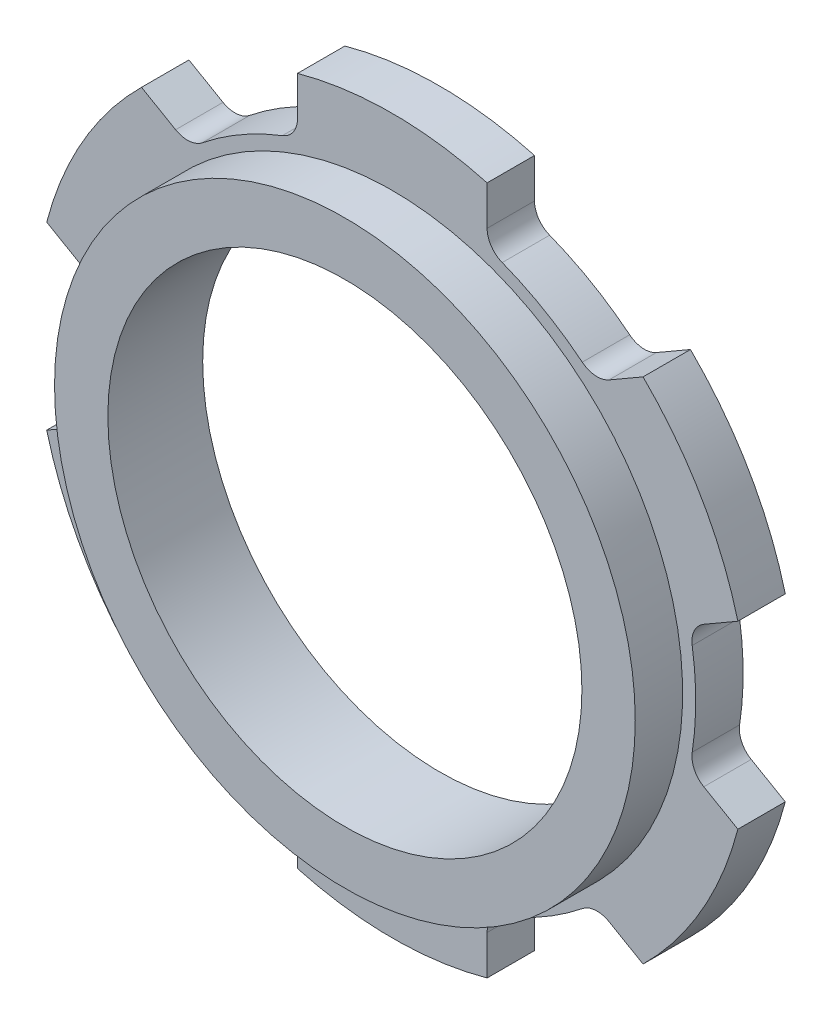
ISO-10303-21;
HEADER;
FILE_DESCRIPTION(('STEP AP214'),'2;1');
FILE_NAME('part.step','',(''),(''),'','','');
FILE_SCHEMA(('AUTOMOTIVE_DESIGN { 1 0 10303 214 1 1 1 1 }'));
ENDSEC;
DATA;
#1=APPLICATION_CONTEXT('core data for automotive mechanical design processes');
#2=APPLICATION_PROTOCOL_DEFINITION('international standard','automotive_design',2000,#1);
#3=PRODUCT_CONTEXT('',#1,'mechanical');
#4=PRODUCT('Part','Part','',(#3));
#5=PRODUCT_RELATED_PRODUCT_CATEGORY('part','',(#4));
#6=PRODUCT_DEFINITION_FORMATION('','',#4);
#7=PRODUCT_DEFINITION_CONTEXT('part definition',#1,'design');
#8=PRODUCT_DEFINITION('design','',#6,#7);
#9=PRODUCT_DEFINITION_SHAPE('','',#8);
#10=(LENGTH_UNIT() NAMED_UNIT(*) SI_UNIT(.MILLI.,.METRE.));
#11=(NAMED_UNIT(*) PLANE_ANGLE_UNIT() SI_UNIT($,.RADIAN.));
#12=(NAMED_UNIT(*) SI_UNIT($,.STERADIAN.) SOLID_ANGLE_UNIT());
#13=UNCERTAINTY_MEASURE_WITH_UNIT(LENGTH_MEASURE(1.E-05),#10,'distance_accuracy_value','');
#14=(GEOMETRIC_REPRESENTATION_CONTEXT(3) GLOBAL_UNCERTAINTY_ASSIGNED_CONTEXT((#13)) GLOBAL_UNIT_ASSIGNED_CONTEXT((#10,
#11,#12)) REPRESENTATION_CONTEXT('',''));
#15=CARTESIAN_POINT('',(0.,0.,0.));
#16=DIRECTION('',(0.,0.,1.));
#17=DIRECTION('',(1.,0.,0.));
#18=AXIS2_PLACEMENT_3D('',#15,#16,#17);
#19=CARTESIAN_POINT('',(0.,0.,2.));
#20=DIRECTION('',(0.,0.,1.));
#21=DIRECTION('',(1.,0.,0.));
#22=AXIS2_PLACEMENT_3D('',#19,#20,#21);
#23=PLANE('',#22);
#24=CARTESIAN_POINT('',(0.,0.,2.));
#25=DIRECTION('',(0.,0.,1.));
#26=DIRECTION('',(1.,0.,0.));
#27=AXIS2_PLACEMENT_3D('',#24,#25,#26);
#28=CIRCLE('',#27,12.25);
#29=CARTESIAN_POINT('',(12.25,0.,2.));
#30=VERTEX_POINT('',#29);
#31=EDGE_CURVE('E436',#30,#30,#28,.T.);
#32=ORIENTED_EDGE('',*,*,#31,.T.);
#33=EDGE_LOOP('',(#32));
#34=FACE_BOUND('',#33,.T.);
#35=CARTESIAN_POINT('',(0.,0.,2.));
#36=DIRECTION('',(0.,0.,1.));
#37=DIRECTION('',(1.,0.,0.));
#38=AXIS2_PLACEMENT_3D('',#35,#36,#37);
#39=CIRCLE('',#38,10.);
#40=CARTESIAN_POINT('',(10.,0.,2.));
#41=VERTEX_POINT('',#40);
#42=EDGE_CURVE('E433',#41,#41,#39,.T.);
#43=ORIENTED_EDGE('',*,*,#42,.F.);
#44=EDGE_LOOP('',(#43));
#45=FACE_BOUND('',#44,.T.);
#46=ADVANCED_FACE('F30',(#34,#45),#23,.T.);
#47=CARTESIAN_POINT('',(0.,0.,2.));
#48=DIRECTION('',(0.,0.,-1.));
#49=DIRECTION('',(-1.,0.,0.));
#50=AXIS2_PLACEMENT_3D('',#47,#48,#49);
#51=CYLINDRICAL_SURFACE('',#50,12.25);
#52=ORIENTED_EDGE('',*,*,#31,.F.);
#53=EDGE_LOOP('',(#52));
#54=FACE_BOUND('',#53,.T.);
#55=CARTESIAN_POINT('',(0.,0.,0.));
#56=DIRECTION('',(0.,0.,-1.));
#57=DIRECTION('',(-1.,0.,0.));
#58=AXIS2_PLACEMENT_3D('',#55,#56,#57);
#59=CIRCLE('',#58,12.25);
#60=CARTESIAN_POINT('',(-12.25,0.,0.));
#61=VERTEX_POINT('',#60);
#62=EDGE_CURVE('E281',#61,#61,#59,.T.);
#63=ORIENTED_EDGE('',*,*,#62,.F.);
#64=EDGE_LOOP('',(#63));
#65=FACE_BOUND('',#64,.T.);
#66=ADVANCED_FACE('F32',(#54,#65),#51,.T.);
#67=CARTESIAN_POINT('',(0.,0.,2.));
#68=DIRECTION('',(0.,0.,-1.));
#69=DIRECTION('',(-1.,0.,0.));
#70=AXIS2_PLACEMENT_3D('',#67,#68,#69);
#71=CYLINDRICAL_SURFACE('',#70,10.);
#72=ORIENTED_EDGE('',*,*,#42,.T.);
#73=EDGE_LOOP('',(#72));
#74=FACE_BOUND('',#73,.T.);
#75=CARTESIAN_POINT('',(0.,1.62351801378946E-13,-2.));
#76=DIRECTION('',(0.,0.,-1.));
#77=DIRECTION('',(-1.,0.,0.));
#78=AXIS2_PLACEMENT_3D('',#75,#76,#77);
#79=CIRCLE('',#78,9.9999999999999);
#80=CARTESIAN_POINT('',(-9.99999999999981,1.62351801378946E-13,-2.));
#81=VERTEX_POINT('',#80);
#82=EDGE_CURVE('E1028',#81,#81,#79,.T.);
#83=ORIENTED_EDGE('',*,*,#82,.T.);
#84=EDGE_LOOP('',(#83));
#85=FACE_BOUND('',#84,.T.);
#86=ADVANCED_FACE('F702',(#74,#85),#71,.F.);
#87=CARTESIAN_POINT('',(0.,1.62351801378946E-13,0.));
#88=DIRECTION('',(0.,0.,-1.));
#89=DIRECTION('',(-1.,0.,0.));
#90=AXIS2_PLACEMENT_3D('',#87,#88,#89);
#91=PLANE('',#90);
#92=CARTESIAN_POINT('',(0.,1.62351801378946E-13,0.));
#93=DIRECTION('',(0.,0.,-1.));
#94=DIRECTION('',(-1.,0.,0.));
#95=AXIS2_PLACEMENT_3D('',#92,#93,#94);
#96=CIRCLE('',#95,12.8023679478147);
#97=CARTESIAN_POINT('',(-8.01524521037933,9.98280868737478,0.));
#98=VERTEX_POINT('',#97);
#99=CARTESIAN_POINT('',(-4.63774331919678,11.9328103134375,0.));
#100=VERTEX_POINT('',#99);
#101=EDGE_CURVE('E274',#98,#100,#96,.T.);
#102=ORIENTED_EDGE('',*,*,#101,.F.);
#103=CARTESIAN_POINT('',(-8.64132042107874,10.76257136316,0.));
#104=DIRECTION('',(0.,0.,-1.));
#105=DIRECTION('',(-1.,0.,0.));
#106=AXIS2_PLACEMENT_3D('',#103,#104,#105);
#107=CIRCLE('',#106,1.);
#108=CARTESIAN_POINT('',(-9.14132042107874,9.89654595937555,0.));
#109=VERTEX_POINT('',#108);
#110=EDGE_CURVE('E536',#98,#109,#107,.T.);
#111=ORIENTED_EDGE('',*,*,#110,.T.);
#112=DIRECTION('',(0.866025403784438,-0.500000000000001,0.));
#113=VECTOR('',#112,1.);
#114=CARTESIAN_POINT('',(-10.5798108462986,10.7270587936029,0.));
#115=LINE('',#114,#113);
#116=CARTESIAN_POINT('',(-10.5798108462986,10.7270587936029,0.));
#117=VERTEX_POINT('',#116);
#118=EDGE_CURVE('E339',#117,#109,#115,.T.);
#119=ORIENTED_EDGE('',*,*,#118,.F.);
#120=CARTESIAN_POINT('',(0.,1.62351801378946E-13,0.));
#121=DIRECTION('',(0.,0.,-1.));
#122=DIRECTION('',(-1.,0.,0.));
#123=AXIS2_PLACEMENT_3D('',#120,#121,#122);
#124=CIRCLE('',#123,15.0665917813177);
#125=CARTESIAN_POINT('',(-14.5798108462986,3.7988555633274,0.));
#126=VERTEX_POINT('',#125);
#127=EDGE_CURVE('E337',#126,#117,#124,.T.);
#128=ORIENTED_EDGE('',*,*,#127,.F.);
#129=DIRECTION('',(-0.866025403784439,0.5,0.));
#130=VECTOR('',#129,1.);
#131=CARTESIAN_POINT('',(-14.5798108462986,3.7988555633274,0.));
#132=LINE('',#131,#130);
#133=CARTESIAN_POINT('',(-13.1413204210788,2.96834272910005,0.));
#134=VERTEX_POINT('',#133);
#135=EDGE_CURVE('E335',#134,#126,#132,.T.);
#136=ORIENTED_EDGE('',*,*,#135,.F.);
#137=CARTESIAN_POINT('',(-13.6413204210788,2.10231732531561,0.));
#138=DIRECTION('',(0.,0.,-1.));
#139=DIRECTION('',(-1.,0.,0.));
#140=AXIS2_PLACEMENT_3D('',#137,#138,#139);
#141=CIRCLE('',#140,1.);
#142=CARTESIAN_POINT('',(-12.6529885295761,1.95000162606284,0.));
#143=VERTEX_POINT('',#142);
#144=EDGE_CURVE('E516',#134,#143,#141,.T.);
#145=ORIENTED_EDGE('',*,*,#144,.T.);
#146=CARTESIAN_POINT('',(0.,1.62351801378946E-13,0.));
#147=DIRECTION('',(0.,0.,-1.));
#148=DIRECTION('',(-1.,0.,0.));
#149=AXIS2_PLACEMENT_3D('',#146,#147,#148);
#150=CIRCLE('',#149,12.8023679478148);
#151=CARTESIAN_POINT('',(-12.6529885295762,-1.95000162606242,0.));
#152=VERTEX_POINT('',#151);
#153=EDGE_CURVE('E332',#152,#143,#150,.T.);
#154=ORIENTED_EDGE('',*,*,#153,.F.);
#155=CARTESIAN_POINT('',(-13.6413204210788,-2.10231732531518,0.));
#156=DIRECTION('',(0.,0.,-1.));
#157=DIRECTION('',(-1.,0.,0.));
#158=AXIS2_PLACEMENT_3D('',#155,#156,#157);
#159=CIRCLE('',#158,1.);
#160=CARTESIAN_POINT('',(-13.1413204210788,-2.96834272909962,0.));
#161=VERTEX_POINT('',#160);
#162=EDGE_CURVE('E520',#152,#161,#159,.T.);
#163=ORIENTED_EDGE('',*,*,#162,.T.);
#164=DIRECTION('',(0.866025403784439,0.5,0.));
#165=VECTOR('',#164,1.);
#166=CARTESIAN_POINT('',(-14.5798108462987,-3.79885556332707,0.));
#167=LINE('',#166,#165);
#168=CARTESIAN_POINT('',(-14.5798108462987,-3.79885556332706,0.));
#169=VERTEX_POINT('',#168);
#170=EDGE_CURVE('E329',#169,#161,#167,.T.);
#171=ORIENTED_EDGE('',*,*,#170,.F.);
#172=CARTESIAN_POINT('',(0.,0.,0.));
#173=DIRECTION('',(0.,0.,-1.));
#174=DIRECTION('',(-1.,0.,0.));
#175=AXIS2_PLACEMENT_3D('',#172,#173,#174);
#176=CIRCLE('',#175,15.0665917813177);
#177=CARTESIAN_POINT('',(-10.5798108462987,-10.7270587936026,0.));
#178=VERTEX_POINT('',#177);
#179=EDGE_CURVE('E327',#178,#169,#176,.T.);
#180=ORIENTED_EDGE('',*,*,#179,.F.);
#181=DIRECTION('',(-0.866025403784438,-0.5,0.));
#182=VECTOR('',#181,1.);
#183=CARTESIAN_POINT('',(-10.5798108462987,-10.7270587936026,0.));
#184=LINE('',#183,#182);
#185=CARTESIAN_POINT('',(-9.14132042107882,-9.89654595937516,0.));
#186=VERTEX_POINT('',#185);
#187=EDGE_CURVE('E325',#186,#178,#184,.T.);
#188=ORIENTED_EDGE('',*,*,#187,.F.);
#189=CARTESIAN_POINT('',(-8.64132042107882,-10.7625713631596,0.));
#190=DIRECTION('',(0.,0.,-1.));
#191=DIRECTION('',(-1.,0.,0.));
#192=AXIS2_PLACEMENT_3D('',#189,#190,#191);
#193=CIRCLE('',#192,1.);
#194=CARTESIAN_POINT('',(-8.0152452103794,-9.9828086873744,0.));
#195=VERTEX_POINT('',#194);
#196=EDGE_CURVE('E508',#186,#195,#193,.T.);
#197=ORIENTED_EDGE('',*,*,#196,.T.);
#198=CARTESIAN_POINT('',(0.,1.62351801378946E-13,0.));
#199=DIRECTION('',(0.,0.,-1.));
#200=DIRECTION('',(-1.,0.,0.));
#201=AXIS2_PLACEMENT_3D('',#198,#199,#200);
#202=CIRCLE('',#201,12.8023679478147);
#203=CARTESIAN_POINT('',(-4.63774331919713,-11.9328103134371,0.));
#204=VERTEX_POINT('',#203);
#205=EDGE_CURVE('E322',#204,#195,#202,.T.);
#206=ORIENTED_EDGE('',*,*,#205,.F.);
#207=CARTESIAN_POINT('',(-5.00000000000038,-12.864888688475,0.));
#208=DIRECTION('',(0.,0.,-1.));
#209=DIRECTION('',(-1.,0.,0.));
#210=AXIS2_PLACEMENT_3D('',#207,#208,#209);
#211=CIRCLE('',#210,1.);
#212=CARTESIAN_POINT('',(-4.00000000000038,-12.864888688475,0.));
#213=VERTEX_POINT('',#212);
#214=EDGE_CURVE('E512',#204,#213,#211,.T.);
#215=ORIENTED_EDGE('',*,*,#214,.T.);
#216=DIRECTION('',(0.,1.,0.));
#217=VECTOR('',#216,1.);
#218=CARTESIAN_POINT('',(-4.00000000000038,-14.52591435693,0.));
#219=LINE('',#218,#217);
#220=CARTESIAN_POINT('',(-4.00000000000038,-14.52591435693,0.));
#221=VERTEX_POINT('',#220);
#222=EDGE_CURVE('E319',#221,#213,#219,.T.);
#223=ORIENTED_EDGE('',*,*,#222,.F.);
#224=CARTESIAN_POINT('',(-3.74935424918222E-13,0.,0.));
#225=DIRECTION('',(0.,0.,-1.));
#226=DIRECTION('',(-1.,0.,0.));
#227=AXIS2_PLACEMENT_3D('',#224,#225,#226);
#228=CIRCLE('',#227,15.0665917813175);
#229=CARTESIAN_POINT('',(3.99999999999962,-14.52591435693,0.));
#230=VERTEX_POINT('',#229);
#231=EDGE_CURVE('E317',#230,#221,#228,.T.);
#232=ORIENTED_EDGE('',*,*,#231,.F.);
#233=DIRECTION('',(0.,-1.,0.));
#234=VECTOR('',#233,1.);
#235=CARTESIAN_POINT('',(3.99999999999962,-14.52591435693,0.));
#236=LINE('',#235,#234);
#237=CARTESIAN_POINT('',(3.99999999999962,-12.8648886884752,0.));
#238=VERTEX_POINT('',#237);
#239=EDGE_CURVE('E315',#238,#230,#236,.T.);
#240=ORIENTED_EDGE('',*,*,#239,.F.);
#241=CARTESIAN_POINT('',(4.99999999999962,-12.8648886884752,0.));
#242=DIRECTION('',(0.,0.,-1.));
#243=DIRECTION('',(-1.,0.,0.));
#244=AXIS2_PLACEMENT_3D('',#241,#242,#243);
#245=CIRCLE('',#244,1.);
#246=CARTESIAN_POINT('',(4.63774331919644,-11.9328103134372,0.));
#247=VERTEX_POINT('',#246);
#248=EDGE_CURVE('E500',#238,#247,#245,.T.);
#249=ORIENTED_EDGE('',*,*,#248,.T.);
#250=CARTESIAN_POINT('',(0.,1.62351801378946E-13,0.));
#251=DIRECTION('',(0.,0.,-1.));
#252=DIRECTION('',(-1.,0.,0.));
#253=AXIS2_PLACEMENT_3D('',#250,#251,#252);
#254=CIRCLE('',#253,12.8023679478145);
#255=CARTESIAN_POINT('',(8.01524521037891,-9.98280868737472,0.));
#256=VERTEX_POINT('',#255);
#257=EDGE_CURVE('E312',#256,#247,#254,.T.);
#258=ORIENTED_EDGE('',*,*,#257,.F.);
#259=CARTESIAN_POINT('',(8.64132042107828,-10.7625713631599,0.));
#260=DIRECTION('',(0.,0.,-1.));
#261=DIRECTION('',(-1.,0.,0.));
#262=AXIS2_PLACEMENT_3D('',#259,#260,#261);
#263=CIRCLE('',#262,1.);
#264=CARTESIAN_POINT('',(9.14132042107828,-9.8965459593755,0.));
#265=VERTEX_POINT('',#264);
#266=EDGE_CURVE('E504',#256,#265,#263,.T.);
#267=ORIENTED_EDGE('',*,*,#266,.T.);
#268=DIRECTION('',(-0.866025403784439,0.499999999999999,0.));
#269=VECTOR('',#268,1.);
#270=CARTESIAN_POINT('',(10.5798108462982,-10.7270587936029,0.));
#271=LINE('',#270,#269);
#272=CARTESIAN_POINT('',(10.5798108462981,-10.7270587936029,0.));
#273=VERTEX_POINT('',#272);
#274=EDGE_CURVE('E309',#273,#265,#271,.T.);
#275=ORIENTED_EDGE('',*,*,#274,.F.);
#276=CARTESIAN_POINT('',(0.,0.,0.));
#277=DIRECTION('',(0.,0.,-1.));
#278=DIRECTION('',(-1.,0.,0.));
#279=AXIS2_PLACEMENT_3D('',#276,#277,#278);
#280=CIRCLE('',#279,15.0665917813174);
#281=CARTESIAN_POINT('',(14.5798108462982,-3.7988555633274,0.));
#282=VERTEX_POINT('',#281);
#283=EDGE_CURVE('E307',#282,#273,#280,.T.);
#284=ORIENTED_EDGE('',*,*,#283,.F.);
#285=DIRECTION('',(0.866025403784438,-0.5,0.));
#286=VECTOR('',#285,1.);
#287=CARTESIAN_POINT('',(14.5798108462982,-3.7988555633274,0.));
#288=LINE('',#287,#286);
#289=CARTESIAN_POINT('',(13.1413204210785,-2.96834272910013,0.));
#290=VERTEX_POINT('',#289);
#291=EDGE_CURVE('E305',#290,#282,#288,.T.);
#292=ORIENTED_EDGE('',*,*,#291,.F.);
#293=CARTESIAN_POINT('',(13.6413204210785,-2.10231732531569,0.));
#294=DIRECTION('',(0.,0.,-1.));
#295=DIRECTION('',(-1.,0.,0.));
#296=AXIS2_PLACEMENT_3D('',#293,#294,#295);
#297=CIRCLE('',#296,1.);
#298=CARTESIAN_POINT('',(12.6529885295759,-1.95000162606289,0.));
#299=VERTEX_POINT('',#298);
#300=EDGE_CURVE('E528',#290,#299,#297,.T.);
#301=ORIENTED_EDGE('',*,*,#300,.T.);
#302=CARTESIAN_POINT('',(0.,1.62351801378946E-13,0.));
#303=DIRECTION('',(0.,0.,-1.));
#304=DIRECTION('',(-1.,0.,0.));
#305=AXIS2_PLACEMENT_3D('',#302,#303,#304);
#306=CIRCLE('',#305,12.8023679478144);
#307=CARTESIAN_POINT('',(12.652988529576,1.95000162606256,0.));
#308=VERTEX_POINT('',#307);
#309=EDGE_CURVE('E302',#308,#299,#306,.T.);
#310=ORIENTED_EDGE('',*,*,#309,.F.);
#311=CARTESIAN_POINT('',(13.6413204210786,2.10231732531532,0.));
#312=DIRECTION('',(0.,0.,-1.));
#313=DIRECTION('',(-1.,0.,0.));
#314=AXIS2_PLACEMENT_3D('',#311,#312,#313);
#315=CIRCLE('',#314,1.);
#316=CARTESIAN_POINT('',(13.1413204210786,2.96834272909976,0.));
#317=VERTEX_POINT('',#316);
#318=EDGE_CURVE('E496',#308,#317,#315,.T.);
#319=ORIENTED_EDGE('',*,*,#318,.T.);
#320=DIRECTION('',(-0.86602540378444,-0.499999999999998,0.));
#321=VECTOR('',#320,1.);
#322=CARTESIAN_POINT('',(14.5798108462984,3.79885556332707,0.));
#323=LINE('',#322,#321);
#324=CARTESIAN_POINT('',(14.5798108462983,3.79885556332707,0.));
#325=VERTEX_POINT('',#324);
#326=EDGE_CURVE('E299',#325,#317,#323,.T.);
#327=ORIENTED_EDGE('',*,*,#326,.F.);
#328=CARTESIAN_POINT('',(0.,0.,0.));
#329=DIRECTION('',(0.,0.,-1.));
#330=DIRECTION('',(-1.,0.,0.));
#331=AXIS2_PLACEMENT_3D('',#328,#329,#330);
#332=CIRCLE('',#331,15.0665917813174);
#333=CARTESIAN_POINT('',(10.5798108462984,10.7270587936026,0.));
#334=VERTEX_POINT('',#333);
#335=EDGE_CURVE('E297',#334,#325,#332,.T.);
#336=ORIENTED_EDGE('',*,*,#335,.F.);
#337=DIRECTION('',(0.866025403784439,0.5,0.));
#338=VECTOR('',#337,1.);
#339=CARTESIAN_POINT('',(10.5798108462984,10.7270587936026,0.));
#340=LINE('',#339,#338);
#341=CARTESIAN_POINT('',(9.14132042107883,9.89654595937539,0.));
#342=VERTEX_POINT('',#341);
#343=EDGE_CURVE('E295',#342,#334,#340,.T.);
#344=ORIENTED_EDGE('',*,*,#343,.F.);
#345=CARTESIAN_POINT('',(8.64132042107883,10.7625713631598,0.));
#346=DIRECTION('',(0.,0.,-1.));
#347=DIRECTION('',(-1.,0.,0.));
#348=AXIS2_PLACEMENT_3D('',#345,#346,#347);
#349=CIRCLE('',#348,1.);
#350=CARTESIAN_POINT('',(8.01524521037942,9.98280868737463,0.));
#351=VERTEX_POINT('',#350);
#352=EDGE_CURVE('E532',#342,#351,#349,.T.);
#353=ORIENTED_EDGE('',*,*,#352,.T.);
#354=CARTESIAN_POINT('',(0.,1.62351801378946E-13,0.));
#355=DIRECTION('',(0.,0.,-1.));
#356=DIRECTION('',(-1.,0.,0.));
#357=AXIS2_PLACEMENT_3D('',#354,#355,#356);
#358=CIRCLE('',#357,12.8023679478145);
#359=CARTESIAN_POINT('',(4.63774331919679,11.9328103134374,0.));
#360=VERTEX_POINT('',#359);
#361=EDGE_CURVE('E289',#360,#351,#358,.T.);
#362=ORIENTED_EDGE('',*,*,#361,.F.);
#363=CARTESIAN_POINT('',(5.,12.8648886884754,0.));
#364=DIRECTION('',(0.,0.,-1.));
#365=DIRECTION('',(-1.,0.,0.));
#366=AXIS2_PLACEMENT_3D('',#363,#364,#365);
#367=CIRCLE('',#366,1.);
#368=CARTESIAN_POINT('',(4.,12.8648886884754,0.));
#369=VERTEX_POINT('',#368);
#370=EDGE_CURVE('E38',#360,#369,#367,.T.);
#371=ORIENTED_EDGE('',*,*,#370,.T.);
#372=DIRECTION('',(0.,-1.,0.));
#373=VECTOR('',#372,1.);
#374=CARTESIAN_POINT('',(4.,14.52591435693,0.));
#375=LINE('',#374,#373);
#376=CARTESIAN_POINT('',(4.,14.52591435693,0.));
#377=VERTEX_POINT('',#376);
#378=EDGE_CURVE('E287',#377,#369,#375,.T.);
#379=ORIENTED_EDGE('',*,*,#378,.F.);
#380=CARTESIAN_POINT('',(0.,0.,0.));
#381=DIRECTION('',(0.,0.,-1.));
#382=DIRECTION('',(-1.,0.,0.));
#383=AXIS2_PLACEMENT_3D('',#380,#381,#382);
#384=CIRCLE('',#383,15.0665917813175);
#385=CARTESIAN_POINT('',(-4.,14.52591435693,0.));
#386=VERTEX_POINT('',#385);
#387=EDGE_CURVE('E273',#386,#377,#384,.T.);
#388=ORIENTED_EDGE('',*,*,#387,.F.);
#389=DIRECTION('',(0.,1.,0.));
#390=VECTOR('',#389,1.);
#391=CARTESIAN_POINT('',(-4.,14.52591435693,0.));
#392=LINE('',#391,#390);
#393=CARTESIAN_POINT('',(-4.,12.8648886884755,0.));
#394=VERTEX_POINT('',#393);
#395=EDGE_CURVE('E264',#394,#386,#392,.T.);
#396=ORIENTED_EDGE('',*,*,#395,.F.);
#397=CARTESIAN_POINT('',(-5.,12.8648886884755,0.));
#398=DIRECTION('',(0.,0.,-1.));
#399=DIRECTION('',(-1.,0.,0.));
#400=AXIS2_PLACEMENT_3D('',#397,#398,#399);
#401=CIRCLE('',#400,1.);
#402=EDGE_CURVE('E524',#394,#100,#401,.T.);
#403=ORIENTED_EDGE('',*,*,#402,.T.);
#404=EDGE_LOOP('',(#102,#111,#119,#128,#136,#145,#154,#163,#171,#180,#188,#197,#206,#215,#223,
#232,#240,#249,#258,#267,#275,#284,#292,#301,#310,#319,#327,#336,#344,#353,#362,#371,#379,#388,
#396,#403));
#405=FACE_BOUND('',#404,.T.);
#406=ORIENTED_EDGE('',*,*,#62,.T.);
#407=EDGE_LOOP('',(#406));
#408=FACE_BOUND('',#407,.T.);
#409=ADVANCED_FACE('F285',(#405,#408),#91,.F.);
#410=CARTESIAN_POINT('',(0.,1.62351801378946E-13,-2.));
#411=DIRECTION('',(0.,0.,-1.));
#412=DIRECTION('',(-1.,0.,0.));
#413=AXIS2_PLACEMENT_3D('',#410,#411,#412);
#414=PLANE('',#413);
#415=DIRECTION('',(0.866025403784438,-0.500000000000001,0.));
#416=VECTOR('',#415,1.);
#417=CARTESIAN_POINT('',(-10.5798108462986,10.7270587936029,-2.));
#418=LINE('',#417,#416);
#419=CARTESIAN_POINT('',(-10.5798108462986,10.7270587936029,-2.));
#420=VERTEX_POINT('',#419);
#421=CARTESIAN_POINT('',(-9.14132042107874,9.89654595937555,-2.));
#422=VERTEX_POINT('',#421);
#423=EDGE_CURVE('E397',#420,#422,#418,.T.);
#424=ORIENTED_EDGE('',*,*,#423,.T.);
#425=CARTESIAN_POINT('',(-8.64132042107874,10.76257136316,-2.));
#426=DIRECTION('',(0.,0.,-1.));
#427=DIRECTION('',(-1.,0.,0.));
#428=AXIS2_PLACEMENT_3D('',#425,#426,#427);
#429=CIRCLE('',#428,1.);
#430=CARTESIAN_POINT('',(-8.01524521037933,9.98280868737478,-2.));
#431=VERTEX_POINT('',#430);
#432=EDGE_CURVE('E538',#422,#431,#429,.F.);
#433=ORIENTED_EDGE('',*,*,#432,.T.);
#434=CARTESIAN_POINT('',(0.,1.62351801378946E-13,-2.));
#435=DIRECTION('',(0.,0.,-1.));
#436=DIRECTION('',(-1.,0.,0.));
#437=AXIS2_PLACEMENT_3D('',#434,#435,#436);
#438=CIRCLE('',#437,12.8023679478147);
#439=CARTESIAN_POINT('',(-4.63774331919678,11.9328103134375,-2.));
#440=VERTEX_POINT('',#439);
#441=EDGE_CURVE('E342',#431,#440,#438,.T.);
#442=ORIENTED_EDGE('',*,*,#441,.T.);
#443=CARTESIAN_POINT('',(-5.,12.8648886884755,-2.));
#444=DIRECTION('',(0.,0.,-1.));
#445=DIRECTION('',(-1.,0.,0.));
#446=AXIS2_PLACEMENT_3D('',#443,#444,#445);
#447=CIRCLE('',#446,1.);
#448=CARTESIAN_POINT('',(-4.,12.8648886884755,-2.));
#449=VERTEX_POINT('',#448);
#450=EDGE_CURVE('E526',#440,#449,#447,.F.);
#451=ORIENTED_EDGE('',*,*,#450,.T.);
#452=DIRECTION('',(0.,1.,0.));
#453=VECTOR('',#452,1.);
#454=CARTESIAN_POINT('',(-4.,14.52591435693,-2.));
#455=LINE('',#454,#453);
#456=CARTESIAN_POINT('',(-4.,14.52591435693,-2.));
#457=VERTEX_POINT('',#456);
#458=EDGE_CURVE('E345',#449,#457,#455,.T.);
#459=ORIENTED_EDGE('',*,*,#458,.T.);
#460=CARTESIAN_POINT('',(0.,0.,-2.));
#461=DIRECTION('',(0.,0.,-1.));
#462=DIRECTION('',(-1.,0.,0.));
#463=AXIS2_PLACEMENT_3D('',#460,#461,#462);
#464=CIRCLE('',#463,15.0665917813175);
#465=CARTESIAN_POINT('',(4.,14.52591435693,-2.));
#466=VERTEX_POINT('',#465);
#467=EDGE_CURVE('E280',#457,#466,#464,.T.);
#468=ORIENTED_EDGE('',*,*,#467,.T.);
#469=DIRECTION('',(0.,-1.,0.));
#470=VECTOR('',#469,1.);
#471=CARTESIAN_POINT('',(4.,14.52591435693,-2.));
#472=LINE('',#471,#470);
#473=CARTESIAN_POINT('',(4.,12.8648886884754,-2.));
#474=VERTEX_POINT('',#473);
#475=EDGE_CURVE('E348',#466,#474,#472,.T.);
#476=ORIENTED_EDGE('',*,*,#475,.T.);
#477=CARTESIAN_POINT('',(5.,12.8648886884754,-2.));
#478=DIRECTION('',(0.,0.,-1.));
#479=DIRECTION('',(-1.,0.,0.));
#480=AXIS2_PLACEMENT_3D('',#477,#478,#479);
#481=CIRCLE('',#480,1.);
#482=CARTESIAN_POINT('',(4.63774331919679,11.9328103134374,-2.));
#483=VERTEX_POINT('',#482);
#484=EDGE_CURVE('E11',#474,#483,#481,.F.);
#485=ORIENTED_EDGE('',*,*,#484,.T.);
#486=CARTESIAN_POINT('',(0.,1.62351801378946E-13,-2.));
#487=DIRECTION('',(0.,0.,-1.));
#488=DIRECTION('',(-1.,0.,0.));
#489=AXIS2_PLACEMENT_3D('',#486,#487,#488);
#490=CIRCLE('',#489,12.8023679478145);
#491=CARTESIAN_POINT('',(8.01524521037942,9.98280868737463,-2.));
#492=VERTEX_POINT('',#491);
#493=EDGE_CURVE('E350',#483,#492,#490,.T.);
#494=ORIENTED_EDGE('',*,*,#493,.T.);
#495=CARTESIAN_POINT('',(8.64132042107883,10.7625713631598,-2.));
#496=DIRECTION('',(0.,0.,-1.));
#497=DIRECTION('',(-1.,0.,0.));
#498=AXIS2_PLACEMENT_3D('',#495,#496,#497);
#499=CIRCLE('',#498,1.);
#500=CARTESIAN_POINT('',(9.14132042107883,9.89654595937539,-2.));
#501=VERTEX_POINT('',#500);
#502=EDGE_CURVE('E534',#492,#501,#499,.F.);
#503=ORIENTED_EDGE('',*,*,#502,.T.);
#504=DIRECTION('',(0.866025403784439,0.5,0.));
#505=VECTOR('',#504,1.);
#506=CARTESIAN_POINT('',(10.5798108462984,10.7270587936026,-2.));
#507=LINE('',#506,#505);
#508=CARTESIAN_POINT('',(10.5798108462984,10.7270587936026,-2.));
#509=VERTEX_POINT('',#508);
#510=EDGE_CURVE('E353',#501,#509,#507,.T.);
#511=ORIENTED_EDGE('',*,*,#510,.T.);
#512=CARTESIAN_POINT('',(0.,0.,-2.));
#513=DIRECTION('',(0.,0.,-1.));
#514=DIRECTION('',(-1.,0.,0.));
#515=AXIS2_PLACEMENT_3D('',#512,#513,#514);
#516=CIRCLE('',#515,15.0665917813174);
#517=CARTESIAN_POINT('',(14.5798108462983,3.79885556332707,-2.));
#518=VERTEX_POINT('',#517);
#519=EDGE_CURVE('E355',#509,#518,#516,.T.);
#520=ORIENTED_EDGE('',*,*,#519,.T.);
#521=DIRECTION('',(-0.86602540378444,-0.499999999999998,0.));
#522=VECTOR('',#521,1.);
#523=CARTESIAN_POINT('',(14.5798108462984,3.79885556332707,-2.));
#524=LINE('',#523,#522);
#525=CARTESIAN_POINT('',(13.1413204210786,2.96834272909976,-2.));
#526=VERTEX_POINT('',#525);
#527=EDGE_CURVE('E357',#518,#526,#524,.T.);
#528=ORIENTED_EDGE('',*,*,#527,.T.);
#529=CARTESIAN_POINT('',(13.6413204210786,2.10231732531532,-2.));
#530=DIRECTION('',(0.,0.,-1.));
#531=DIRECTION('',(-1.,0.,0.));
#532=AXIS2_PLACEMENT_3D('',#529,#530,#531);
#533=CIRCLE('',#532,1.);
#534=CARTESIAN_POINT('',(12.652988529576,1.95000162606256,-2.));
#535=VERTEX_POINT('',#534);
#536=EDGE_CURVE('E498',#526,#535,#533,.F.);
#537=ORIENTED_EDGE('',*,*,#536,.T.);
#538=CARTESIAN_POINT('',(0.,1.62351801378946E-13,-2.));
#539=DIRECTION('',(0.,0.,-1.));
#540=DIRECTION('',(-1.,0.,0.));
#541=AXIS2_PLACEMENT_3D('',#538,#539,#540);
#542=CIRCLE('',#541,12.8023679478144);
#543=CARTESIAN_POINT('',(12.6529885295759,-1.95000162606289,-2.));
#544=VERTEX_POINT('',#543);
#545=EDGE_CURVE('E360',#535,#544,#542,.T.);
#546=ORIENTED_EDGE('',*,*,#545,.T.);
#547=CARTESIAN_POINT('',(13.6413204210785,-2.10231732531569,-2.));
#548=DIRECTION('',(0.,0.,-1.));
#549=DIRECTION('',(-1.,0.,0.));
#550=AXIS2_PLACEMENT_3D('',#547,#548,#549);
#551=CIRCLE('',#550,1.);
#552=CARTESIAN_POINT('',(13.1413204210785,-2.96834272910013,-2.));
#553=VERTEX_POINT('',#552);
#554=EDGE_CURVE('E530',#544,#553,#551,.F.);
#555=ORIENTED_EDGE('',*,*,#554,.T.);
#556=DIRECTION('',(0.866025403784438,-0.5,0.));
#557=VECTOR('',#556,1.);
#558=CARTESIAN_POINT('',(14.5798108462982,-3.7988555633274,-2.));
#559=LINE('',#558,#557);
#560=CARTESIAN_POINT('',(14.5798108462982,-3.7988555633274,-2.));
#561=VERTEX_POINT('',#560);
#562=EDGE_CURVE('E363',#553,#561,#559,.T.);
#563=ORIENTED_EDGE('',*,*,#562,.T.);
#564=CARTESIAN_POINT('',(0.,0.,-2.));
#565=DIRECTION('',(0.,0.,-1.));
#566=DIRECTION('',(-1.,0.,0.));
#567=AXIS2_PLACEMENT_3D('',#564,#565,#566);
#568=CIRCLE('',#567,15.0665917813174);
#569=CARTESIAN_POINT('',(10.5798108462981,-10.7270587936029,-2.));
#570=VERTEX_POINT('',#569);
#571=EDGE_CURVE('E365',#561,#570,#568,.T.);
#572=ORIENTED_EDGE('',*,*,#571,.T.);
#573=DIRECTION('',(-0.866025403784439,0.499999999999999,0.));
#574=VECTOR('',#573,1.);
#575=CARTESIAN_POINT('',(10.5798108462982,-10.7270587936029,-2.));
#576=LINE('',#575,#574);
#577=CARTESIAN_POINT('',(9.14132042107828,-9.8965459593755,-2.));
#578=VERTEX_POINT('',#577);
#579=EDGE_CURVE('E367',#570,#578,#576,.T.);
#580=ORIENTED_EDGE('',*,*,#579,.T.);
#581=CARTESIAN_POINT('',(8.64132042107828,-10.7625713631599,-2.));
#582=DIRECTION('',(0.,0.,-1.));
#583=DIRECTION('',(-1.,0.,0.));
#584=AXIS2_PLACEMENT_3D('',#581,#582,#583);
#585=CIRCLE('',#584,1.);
#586=CARTESIAN_POINT('',(8.01524521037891,-9.98280868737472,-2.));
#587=VERTEX_POINT('',#586);
#588=EDGE_CURVE('E506',#578,#587,#585,.F.);
#589=ORIENTED_EDGE('',*,*,#588,.T.);
#590=CARTESIAN_POINT('',(0.,1.62351801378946E-13,-2.));
#591=DIRECTION('',(0.,0.,-1.));
#592=DIRECTION('',(-1.,0.,0.));
#593=AXIS2_PLACEMENT_3D('',#590,#591,#592);
#594=CIRCLE('',#593,12.8023679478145);
#595=CARTESIAN_POINT('',(4.63774331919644,-11.9328103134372,-2.));
#596=VERTEX_POINT('',#595);
#597=EDGE_CURVE('E370',#587,#596,#594,.T.);
#598=ORIENTED_EDGE('',*,*,#597,.T.);
#599=CARTESIAN_POINT('',(4.99999999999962,-12.8648886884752,-2.));
#600=DIRECTION('',(0.,0.,-1.));
#601=DIRECTION('',(-1.,0.,0.));
#602=AXIS2_PLACEMENT_3D('',#599,#600,#601);
#603=CIRCLE('',#602,1.);
#604=CARTESIAN_POINT('',(3.99999999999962,-12.8648886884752,-2.));
#605=VERTEX_POINT('',#604);
#606=EDGE_CURVE('E502',#596,#605,#603,.F.);
#607=ORIENTED_EDGE('',*,*,#606,.T.);
#608=DIRECTION('',(0.,-1.,0.));
#609=VECTOR('',#608,1.);
#610=CARTESIAN_POINT('',(3.99999999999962,-14.52591435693,-2.));
#611=LINE('',#610,#609);
#612=CARTESIAN_POINT('',(3.99999999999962,-14.52591435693,-2.));
#613=VERTEX_POINT('',#612);
#614=EDGE_CURVE('E373',#605,#613,#611,.T.);
#615=ORIENTED_EDGE('',*,*,#614,.T.);
#616=CARTESIAN_POINT('',(-3.74935424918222E-13,0.,-2.));
#617=DIRECTION('',(0.,0.,-1.));
#618=DIRECTION('',(-1.,0.,0.));
#619=AXIS2_PLACEMENT_3D('',#616,#617,#618);
#620=CIRCLE('',#619,15.0665917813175);
#621=CARTESIAN_POINT('',(-4.00000000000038,-14.52591435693,-2.));
#622=VERTEX_POINT('',#621);
#623=EDGE_CURVE('E375',#613,#622,#620,.T.);
#624=ORIENTED_EDGE('',*,*,#623,.T.);
#625=DIRECTION('',(0.,1.,0.));
#626=VECTOR('',#625,1.);
#627=CARTESIAN_POINT('',(-4.00000000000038,-14.52591435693,-2.));
#628=LINE('',#627,#626);
#629=CARTESIAN_POINT('',(-4.00000000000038,-12.864888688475,-2.));
#630=VERTEX_POINT('',#629);
#631=EDGE_CURVE('E377',#622,#630,#628,.T.);
#632=ORIENTED_EDGE('',*,*,#631,.T.);
#633=CARTESIAN_POINT('',(-5.00000000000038,-12.864888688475,-2.));
#634=DIRECTION('',(0.,0.,-1.));
#635=DIRECTION('',(-1.,0.,0.));
#636=AXIS2_PLACEMENT_3D('',#633,#634,#635);
#637=CIRCLE('',#636,1.);
#638=CARTESIAN_POINT('',(-4.63774331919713,-11.9328103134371,-2.));
#639=VERTEX_POINT('',#638);
#640=EDGE_CURVE('E514',#630,#639,#637,.F.);
#641=ORIENTED_EDGE('',*,*,#640,.T.);
#642=CARTESIAN_POINT('',(0.,1.62351801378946E-13,-2.));
#643=DIRECTION('',(0.,0.,-1.));
#644=DIRECTION('',(-1.,0.,0.));
#645=AXIS2_PLACEMENT_3D('',#642,#643,#644);
#646=CIRCLE('',#645,12.8023679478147);
#647=CARTESIAN_POINT('',(-8.0152452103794,-9.9828086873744,-2.));
#648=VERTEX_POINT('',#647);
#649=EDGE_CURVE('E380',#639,#648,#646,.T.);
#650=ORIENTED_EDGE('',*,*,#649,.T.);
#651=CARTESIAN_POINT('',(-8.64132042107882,-10.7625713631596,-2.));
#652=DIRECTION('',(0.,0.,-1.));
#653=DIRECTION('',(-1.,0.,0.));
#654=AXIS2_PLACEMENT_3D('',#651,#652,#653);
#655=CIRCLE('',#654,1.);
#656=CARTESIAN_POINT('',(-9.14132042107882,-9.89654595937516,-2.));
#657=VERTEX_POINT('',#656);
#658=EDGE_CURVE('E510',#648,#657,#655,.F.);
#659=ORIENTED_EDGE('',*,*,#658,.T.);
#660=DIRECTION('',(-0.866025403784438,-0.5,0.));
#661=VECTOR('',#660,1.);
#662=CARTESIAN_POINT('',(-10.5798108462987,-10.7270587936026,-2.));
#663=LINE('',#662,#661);
#664=CARTESIAN_POINT('',(-10.5798108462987,-10.7270587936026,-2.));
#665=VERTEX_POINT('',#664);
#666=EDGE_CURVE('E383',#657,#665,#663,.T.);
#667=ORIENTED_EDGE('',*,*,#666,.T.);
#668=CARTESIAN_POINT('',(0.,0.,-2.));
#669=DIRECTION('',(0.,0.,-1.));
#670=DIRECTION('',(-1.,0.,0.));
#671=AXIS2_PLACEMENT_3D('',#668,#669,#670);
#672=CIRCLE('',#671,15.0665917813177);
#673=CARTESIAN_POINT('',(-14.5798108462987,-3.79885556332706,-2.));
#674=VERTEX_POINT('',#673);
#675=EDGE_CURVE('E385',#665,#674,#672,.T.);
#676=ORIENTED_EDGE('',*,*,#675,.T.);
#677=DIRECTION('',(0.866025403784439,0.5,0.));
#678=VECTOR('',#677,1.);
#679=CARTESIAN_POINT('',(-14.5798108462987,-3.79885556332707,-2.));
#680=LINE('',#679,#678);
#681=CARTESIAN_POINT('',(-13.1413204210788,-2.96834272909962,-2.));
#682=VERTEX_POINT('',#681);
#683=EDGE_CURVE('E387',#674,#682,#680,.T.);
#684=ORIENTED_EDGE('',*,*,#683,.T.);
#685=CARTESIAN_POINT('',(-13.6413204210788,-2.10231732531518,-2.));
#686=DIRECTION('',(0.,0.,-1.));
#687=DIRECTION('',(-1.,0.,0.));
#688=AXIS2_PLACEMENT_3D('',#685,#686,#687);
#689=CIRCLE('',#688,1.);
#690=CARTESIAN_POINT('',(-12.6529885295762,-1.95000162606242,-2.));
#691=VERTEX_POINT('',#690);
#692=EDGE_CURVE('E522',#682,#691,#689,.F.);
#693=ORIENTED_EDGE('',*,*,#692,.T.);
#694=CARTESIAN_POINT('',(0.,1.62351801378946E-13,-2.));
#695=DIRECTION('',(0.,0.,-1.));
#696=DIRECTION('',(-1.,0.,0.));
#697=AXIS2_PLACEMENT_3D('',#694,#695,#696);
#698=CIRCLE('',#697,12.8023679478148);
#699=CARTESIAN_POINT('',(-12.6529885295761,1.95000162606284,-2.));
#700=VERTEX_POINT('',#699);
#701=EDGE_CURVE('E390',#691,#700,#698,.T.);
#702=ORIENTED_EDGE('',*,*,#701,.T.);
#703=CARTESIAN_POINT('',(-13.6413204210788,2.10231732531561,-2.));
#704=DIRECTION('',(0.,0.,-1.));
#705=DIRECTION('',(-1.,0.,0.));
#706=AXIS2_PLACEMENT_3D('',#703,#704,#705);
#707=CIRCLE('',#706,1.);
#708=CARTESIAN_POINT('',(-13.1413204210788,2.96834272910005,-2.));
#709=VERTEX_POINT('',#708);
#710=EDGE_CURVE('E518',#700,#709,#707,.F.);
#711=ORIENTED_EDGE('',*,*,#710,.T.);
#712=DIRECTION('',(-0.866025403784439,0.5,0.));
#713=VECTOR('',#712,1.);
#714=CARTESIAN_POINT('',(-14.5798108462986,3.7988555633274,-2.));
#715=LINE('',#714,#713);
#716=CARTESIAN_POINT('',(-14.5798108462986,3.7988555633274,-2.));
#717=VERTEX_POINT('',#716);
#718=EDGE_CURVE('E393',#709,#717,#715,.T.);
#719=ORIENTED_EDGE('',*,*,#718,.T.);
#720=CARTESIAN_POINT('',(0.,1.62351801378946E-13,-2.));
#721=DIRECTION('',(0.,0.,-1.));
#722=DIRECTION('',(-1.,0.,0.));
#723=AXIS2_PLACEMENT_3D('',#720,#721,#722);
#724=CIRCLE('',#723,15.0665917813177);
#725=EDGE_CURVE('E395',#717,#420,#724,.T.);
#726=ORIENTED_EDGE('',*,*,#725,.T.);
#727=EDGE_LOOP('',(#424,#433,#442,#451,#459,#468,#476,#485,#494,#503,#511,#520,#528,#537,#546,
#555,#563,#572,#580,#589,#598,#607,#615,#624,#632,#641,#650,#659,#667,#676,#684,#693,#702,#711,
#719,#726));
#728=FACE_BOUND('',#727,.T.);
#729=ORIENTED_EDGE('',*,*,#82,.F.);
#730=EDGE_LOOP('',(#729));
#731=FACE_BOUND('',#730,.T.);
#732=ADVANCED_FACE('F542',(#728,#731),#414,.T.);
#733=CARTESIAN_POINT('',(0.,1.62351801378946E-13,-2.));
#734=DIRECTION('',(0.,0.,1.));
#735=DIRECTION('',(1.,0.,0.));
#736=AXIS2_PLACEMENT_3D('',#733,#734,#735);
#737=CYLINDRICAL_SURFACE('',#736,12.8023679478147);
#738=ORIENTED_EDGE('',*,*,#101,.T.);
#739=DIRECTION('',(0.,0.,1.));
#740=VECTOR('',#739,1.);
#741=CARTESIAN_POINT('',(-4.63774331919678,11.9328103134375,-2.));
#742=LINE('',#741,#740);
#743=EDGE_CURVE('E480',#100,#440,#742,.F.);
#744=ORIENTED_EDGE('',*,*,#743,.T.);
#745=ORIENTED_EDGE('',*,*,#441,.F.);
#746=DIRECTION('',(0.,0.,1.));
#747=VECTOR('',#746,1.);
#748=CARTESIAN_POINT('',(-8.01524521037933,9.98280868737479,-2.));
#749=LINE('',#748,#747);
#750=EDGE_CURVE('E477',#431,#98,#749,.T.);
#751=ORIENTED_EDGE('',*,*,#750,.T.);
#752=EDGE_LOOP('',(#738,#744,#745,#751));
#753=FACE_BOUND('',#752,.T.);
#754=ADVANCED_FACE('F551',(#753),#737,.T.);
#755=CARTESIAN_POINT('',(-4.,14.52591435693,-2.));
#756=DIRECTION('',(1.,0.,0.));
#757=DIRECTION('',(0.,0.,-1.));
#758=AXIS2_PLACEMENT_3D('',#755,#756,#757);
#759=PLANE('',#758);
#760=ORIENTED_EDGE('',*,*,#458,.F.);
#761=DIRECTION('',(0.,0.,-1.));
#762=VECTOR('',#761,1.);
#763=CARTESIAN_POINT('',(-4.,12.8648886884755,0.));
#764=LINE('',#763,#762);
#765=EDGE_CURVE('E271',#449,#394,#764,.F.);
#766=ORIENTED_EDGE('',*,*,#765,.T.);
#767=ORIENTED_EDGE('',*,*,#395,.T.);
#768=DIRECTION('',(0.,0.,1.));
#769=VECTOR('',#768,1.);
#770=CARTESIAN_POINT('',(-4.,14.52591435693,-2.));
#771=LINE('',#770,#769);
#772=EDGE_CURVE('E268',#457,#386,#771,.T.);
#773=ORIENTED_EDGE('',*,*,#772,.F.);
#774=EDGE_LOOP('',(#760,#766,#767,#773));
#775=FACE_BOUND('',#774,.T.);
#776=ADVANCED_FACE('F267',(#775),#759,.F.);
#777=CARTESIAN_POINT('',(0.,0.,-2.));
#778=DIRECTION('',(0.,0.,1.));
#779=DIRECTION('',(1.,0.,0.));
#780=AXIS2_PLACEMENT_3D('',#777,#778,#779);
#781=CYLINDRICAL_SURFACE('',#780,15.0665917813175);
#782=ORIENTED_EDGE('',*,*,#387,.T.);
#783=DIRECTION('',(0.,0.,1.));
#784=VECTOR('',#783,1.);
#785=CARTESIAN_POINT('',(4.,14.52591435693,-2.));
#786=LINE('',#785,#784);
#787=EDGE_CURVE('E282',#466,#377,#786,.T.);
#788=ORIENTED_EDGE('',*,*,#787,.F.);
#789=ORIENTED_EDGE('',*,*,#467,.F.);
#790=ORIENTED_EDGE('',*,*,#772,.T.);
#791=EDGE_LOOP('',(#782,#788,#789,#790));
#792=FACE_BOUND('',#791,.T.);
#793=ADVANCED_FACE('F277',(#792),#781,.T.);
#794=CARTESIAN_POINT('',(4.,14.52591435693,-2.));
#795=DIRECTION('',(-1.,0.,0.));
#796=DIRECTION('',(0.,0.,1.));
#797=AXIS2_PLACEMENT_3D('',#794,#795,#796);
#798=PLANE('',#797);
#799=ORIENTED_EDGE('',*,*,#378,.T.);
#800=DIRECTION('',(0.,0.,-1.));
#801=VECTOR('',#800,1.);
#802=CARTESIAN_POINT('',(4.,12.8648886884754,-2.));
#803=LINE('',#802,#801);
#804=EDGE_CURVE('E45',#369,#474,#803,.T.);
#805=ORIENTED_EDGE('',*,*,#804,.T.);
#806=ORIENTED_EDGE('',*,*,#475,.F.);
#807=ORIENTED_EDGE('',*,*,#787,.T.);
#808=EDGE_LOOP('',(#799,#805,#806,#807));
#809=FACE_BOUND('',#808,.T.);
#810=ADVANCED_FACE('F715',(#809),#798,.F.);
#811=CARTESIAN_POINT('',(0.,1.62351801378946E-13,-2.));
#812=DIRECTION('',(0.,0.,1.));
#813=DIRECTION('',(1.,0.,0.));
#814=AXIS2_PLACEMENT_3D('',#811,#812,#813);
#815=CYLINDRICAL_SURFACE('',#814,12.8023679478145);
#816=ORIENTED_EDGE('',*,*,#361,.T.);
#817=DIRECTION('',(0.,0.,1.));
#818=VECTOR('',#817,1.);
#819=CARTESIAN_POINT('',(8.01524521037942,9.98280868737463,-2.));
#820=LINE('',#819,#818);
#821=EDGE_CURVE('E491',#351,#492,#820,.F.);
#822=ORIENTED_EDGE('',*,*,#821,.T.);
#823=ORIENTED_EDGE('',*,*,#493,.F.);
#824=DIRECTION('',(0.,0.,1.));
#825=VECTOR('',#824,1.);
#826=CARTESIAN_POINT('',(4.63774331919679,11.9328103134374,-2.));
#827=LINE('',#826,#825);
#828=EDGE_CURVE('E488',#483,#360,#827,.T.);
#829=ORIENTED_EDGE('',*,*,#828,.T.);
#830=EDGE_LOOP('',(#816,#822,#823,#829));
#831=FACE_BOUND('',#830,.T.);
#832=ADVANCED_FACE('F686',(#831),#815,.T.);
#833=CARTESIAN_POINT('',(10.5798108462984,10.7270587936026,-2.));
#834=DIRECTION('',(0.5,-0.866025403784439,0.));
#835=DIRECTION('',(0.866025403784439,0.5,0.));
#836=AXIS2_PLACEMENT_3D('',#833,#834,#835);
#837=PLANE('',#836);
#838=ORIENTED_EDGE('',*,*,#510,.F.);
#839=DIRECTION('',(0.,0.,-1.));
#840=VECTOR('',#839,1.);
#841=CARTESIAN_POINT('',(9.14132042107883,9.89654595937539,0.));
#842=LINE('',#841,#840);
#843=EDGE_CURVE('E485',#501,#342,#842,.F.);
#844=ORIENTED_EDGE('',*,*,#843,.T.);
#845=ORIENTED_EDGE('',*,*,#343,.T.);
#846=DIRECTION('',(0.,0.,1.));
#847=VECTOR('',#846,1.);
#848=CARTESIAN_POINT('',(10.5798108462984,10.7270587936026,-2.));
#849=LINE('',#848,#847);
#850=EDGE_CURVE('E427',#509,#334,#849,.T.);
#851=ORIENTED_EDGE('',*,*,#850,.F.);
#852=EDGE_LOOP('',(#838,#844,#845,#851));
#853=FACE_BOUND('',#852,.T.);
#854=ADVANCED_FACE('F678',(#853),#837,.F.);
#855=CARTESIAN_POINT('',(0.,0.,-2.));
#856=DIRECTION('',(0.,0.,1.));
#857=DIRECTION('',(1.,0.,0.));
#858=AXIS2_PLACEMENT_3D('',#855,#856,#857);
#859=CYLINDRICAL_SURFACE('',#858,15.0665917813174);
#860=ORIENTED_EDGE('',*,*,#335,.T.);
#861=DIRECTION('',(0.,0.,1.));
#862=VECTOR('',#861,1.);
#863=CARTESIAN_POINT('',(14.5798108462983,3.79885556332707,-2.));
#864=LINE('',#863,#862);
#865=EDGE_CURVE('E424',#518,#325,#864,.T.);
#866=ORIENTED_EDGE('',*,*,#865,.F.);
#867=ORIENTED_EDGE('',*,*,#519,.F.);
#868=ORIENTED_EDGE('',*,*,#850,.T.);
#869=EDGE_LOOP('',(#860,#866,#867,#868));
#870=FACE_BOUND('',#869,.T.);
#871=ADVANCED_FACE('F673',(#870),#859,.T.);
#872=CARTESIAN_POINT('',(14.5798108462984,3.79885556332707,-2.));
#873=DIRECTION('',(-0.499999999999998,0.86602540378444,0.));
#874=DIRECTION('',(-0.86602540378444,-0.499999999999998,0.));
#875=AXIS2_PLACEMENT_3D('',#872,#873,#874);
#876=PLANE('',#875);
#877=ORIENTED_EDGE('',*,*,#326,.T.);
#878=DIRECTION('',(0.,0.,-1.));
#879=VECTOR('',#878,1.);
#880=CARTESIAN_POINT('',(13.1413204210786,2.96834272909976,-2.));
#881=LINE('',#880,#879);
#882=EDGE_CURVE('E444',#317,#526,#881,.T.);
#883=ORIENTED_EDGE('',*,*,#882,.T.);
#884=ORIENTED_EDGE('',*,*,#527,.F.);
#885=ORIENTED_EDGE('',*,*,#865,.T.);
#886=EDGE_LOOP('',(#877,#883,#884,#885));
#887=FACE_BOUND('',#886,.T.);
#888=ADVANCED_FACE('F669',(#887),#876,.F.);
#889=CARTESIAN_POINT('',(0.,1.62351801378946E-13,-2.));
#890=DIRECTION('',(0.,0.,1.));
#891=DIRECTION('',(1.,0.,0.));
#892=AXIS2_PLACEMENT_3D('',#889,#890,#891);
#893=CYLINDRICAL_SURFACE('',#892,12.8023679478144);
#894=ORIENTED_EDGE('',*,*,#545,.F.);
#895=DIRECTION('',(0.,0.,1.));
#896=VECTOR('',#895,1.);
#897=CARTESIAN_POINT('',(12.652988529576,1.95000162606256,-2.));
#898=LINE('',#897,#896);
#899=EDGE_CURVE('E441',#535,#308,#898,.T.);
#900=ORIENTED_EDGE('',*,*,#899,.T.);
#901=ORIENTED_EDGE('',*,*,#309,.T.);
#902=DIRECTION('',(0.,0.,1.));
#903=VECTOR('',#902,1.);
#904=CARTESIAN_POINT('',(12.6529885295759,-1.95000162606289,-2.));
#905=LINE('',#904,#903);
#906=EDGE_CURVE('E439',#299,#544,#905,.F.);
#907=ORIENTED_EDGE('',*,*,#906,.T.);
#908=EDGE_LOOP('',(#894,#900,#901,#907));
#909=FACE_BOUND('',#908,.T.);
#910=ADVANCED_FACE('F659',(#909),#893,.T.);
#911=CARTESIAN_POINT('',(14.5798108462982,-3.7988555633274,-2.));
#912=DIRECTION('',(-0.5,-0.866025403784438,0.));
#913=DIRECTION('',(0.866025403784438,-0.5,0.));
#914=AXIS2_PLACEMENT_3D('',#911,#912,#913);
#915=PLANE('',#914);
#916=ORIENTED_EDGE('',*,*,#562,.F.);
#917=DIRECTION('',(0.,0.,-1.));
#918=VECTOR('',#917,1.);
#919=CARTESIAN_POINT('',(13.1413204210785,-2.96834272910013,0.));
#920=LINE('',#919,#918);
#921=EDGE_CURVE('E482',#553,#290,#920,.F.);
#922=ORIENTED_EDGE('',*,*,#921,.T.);
#923=ORIENTED_EDGE('',*,*,#291,.T.);
#924=DIRECTION('',(0.,0.,1.));
#925=VECTOR('',#924,1.);
#926=CARTESIAN_POINT('',(14.5798108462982,-3.7988555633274,-2.));
#927=LINE('',#926,#925);
#928=EDGE_CURVE('E421',#561,#282,#927,.T.);
#929=ORIENTED_EDGE('',*,*,#928,.F.);
#930=EDGE_LOOP('',(#916,#922,#923,#929));
#931=FACE_BOUND('',#930,.T.);
#932=ADVANCED_FACE('F651',(#931),#915,.F.);
#933=CARTESIAN_POINT('',(0.,0.,-2.));
#934=DIRECTION('',(0.,0.,1.));
#935=DIRECTION('',(1.,0.,0.));
#936=AXIS2_PLACEMENT_3D('',#933,#934,#935);
#937=CYLINDRICAL_SURFACE('',#936,15.0665917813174);
#938=ORIENTED_EDGE('',*,*,#283,.T.);
#939=DIRECTION('',(0.,0.,1.));
#940=VECTOR('',#939,1.);
#941=CARTESIAN_POINT('',(10.5798108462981,-10.7270587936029,-2.));
#942=LINE('',#941,#940);
#943=EDGE_CURVE('E418',#570,#273,#942,.T.);
#944=ORIENTED_EDGE('',*,*,#943,.F.);
#945=ORIENTED_EDGE('',*,*,#571,.F.);
#946=ORIENTED_EDGE('',*,*,#928,.T.);
#947=EDGE_LOOP('',(#938,#944,#945,#946));
#948=FACE_BOUND('',#947,.T.);
#949=ADVANCED_FACE('F645',(#948),#937,.T.);
#950=CARTESIAN_POINT('',(10.5798108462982,-10.7270587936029,-2.));
#951=DIRECTION('',(0.499999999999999,0.866025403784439,0.));
#952=DIRECTION('',(-0.866025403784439,0.499999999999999,0.));
#953=AXIS2_PLACEMENT_3D('',#950,#951,#952);
#954=PLANE('',#953);
#955=ORIENTED_EDGE('',*,*,#274,.T.);
#956=DIRECTION('',(0.,0.,-1.));
#957=VECTOR('',#956,1.);
#958=CARTESIAN_POINT('',(9.14132042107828,-9.8965459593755,-2.));
#959=LINE('',#958,#957);
#960=EDGE_CURVE('E454',#265,#578,#959,.T.);
#961=ORIENTED_EDGE('',*,*,#960,.T.);
#962=ORIENTED_EDGE('',*,*,#579,.F.);
#963=ORIENTED_EDGE('',*,*,#943,.T.);
#964=EDGE_LOOP('',(#955,#961,#962,#963));
#965=FACE_BOUND('',#964,.T.);
#966=ADVANCED_FACE('F641',(#965),#954,.F.);
#967=CARTESIAN_POINT('',(0.,1.62351801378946E-13,-2.));
#968=DIRECTION('',(0.,0.,1.));
#969=DIRECTION('',(1.,0.,0.));
#970=AXIS2_PLACEMENT_3D('',#967,#968,#969);
#971=CYLINDRICAL_SURFACE('',#970,12.8023679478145);
#972=ORIENTED_EDGE('',*,*,#257,.T.);
#973=DIRECTION('',(0.,0.,1.));
#974=VECTOR('',#973,1.);
#975=CARTESIAN_POINT('',(4.63774331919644,-11.9328103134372,-2.));
#976=LINE('',#975,#974);
#977=EDGE_CURVE('E452',#247,#596,#976,.F.);
#978=ORIENTED_EDGE('',*,*,#977,.T.);
#979=ORIENTED_EDGE('',*,*,#597,.F.);
#980=DIRECTION('',(0.,0.,1.));
#981=VECTOR('',#980,1.);
#982=CARTESIAN_POINT('',(8.01524521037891,-9.98280868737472,-2.));
#983=LINE('',#982,#981);
#984=EDGE_CURVE('E449',#587,#256,#983,.T.);
#985=ORIENTED_EDGE('',*,*,#984,.T.);
#986=EDGE_LOOP('',(#972,#978,#979,#985));
#987=FACE_BOUND('',#986,.T.);
#988=ADVANCED_FACE('F631',(#987),#971,.T.);
#989=CARTESIAN_POINT('',(3.99999999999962,-14.52591435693,-2.));
#990=DIRECTION('',(-1.,0.,0.));
#991=DIRECTION('',(0.,-1.,0.));
#992=AXIS2_PLACEMENT_3D('',#989,#990,#991);
#993=PLANE('',#992);
#994=ORIENTED_EDGE('',*,*,#614,.F.);
#995=DIRECTION('',(0.,0.,-1.));
#996=VECTOR('',#995,1.);
#997=CARTESIAN_POINT('',(3.99999999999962,-12.8648886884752,0.));
#998=LINE('',#997,#996);
#999=EDGE_CURVE('E446',#605,#238,#998,.F.);
#1000=ORIENTED_EDGE('',*,*,#999,.T.);
#1001=ORIENTED_EDGE('',*,*,#239,.T.);
#1002=DIRECTION('',(0.,0.,1.));
#1003=VECTOR('',#1002,1.);
#1004=CARTESIAN_POINT('',(3.99999999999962,-14.52591435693,-2.));
#1005=LINE('',#1004,#1003);
#1006=EDGE_CURVE('E415',#613,#230,#1005,.T.);
#1007=ORIENTED_EDGE('',*,*,#1006,.F.);
#1008=EDGE_LOOP('',(#994,#1000,#1001,#1007));
#1009=FACE_BOUND('',#1008,.T.);
#1010=ADVANCED_FACE('F623',(#1009),#993,.F.);
#1011=CARTESIAN_POINT('',(-3.74935424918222E-13,0.,-2.));
#1012=DIRECTION('',(0.,0.,1.));
#1013=DIRECTION('',(1.,0.,0.));
#1014=AXIS2_PLACEMENT_3D('',#1011,#1012,#1013);
#1015=CYLINDRICAL_SURFACE('',#1014,15.0665917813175);
#1016=ORIENTED_EDGE('',*,*,#231,.T.);
#1017=DIRECTION('',(0.,0.,1.));
#1018=VECTOR('',#1017,1.);
#1019=CARTESIAN_POINT('',(-4.00000000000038,-14.52591435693,-2.));
#1020=LINE('',#1019,#1018);
#1021=EDGE_CURVE('E412',#622,#221,#1020,.T.);
#1022=ORIENTED_EDGE('',*,*,#1021,.F.);
#1023=ORIENTED_EDGE('',*,*,#623,.F.);
#1024=ORIENTED_EDGE('',*,*,#1006,.T.);
#1025=EDGE_LOOP('',(#1016,#1022,#1023,#1024));
#1026=FACE_BOUND('',#1025,.T.);
#1027=ADVANCED_FACE('F617',(#1026),#1015,.T.);
#1028=CARTESIAN_POINT('',(-4.00000000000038,-14.52591435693,-2.));
#1029=DIRECTION('',(1.,0.,0.));
#1030=DIRECTION('',(0.,0.,-1.));
#1031=AXIS2_PLACEMENT_3D('',#1028,#1029,#1030);
#1032=PLANE('',#1031);
#1033=ORIENTED_EDGE('',*,*,#222,.T.);
#1034=DIRECTION('',(0.,0.,-1.));
#1035=VECTOR('',#1034,1.);
#1036=CARTESIAN_POINT('',(-4.00000000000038,-12.864888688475,-2.));
#1037=LINE('',#1036,#1035);
#1038=EDGE_CURVE('E464',#213,#630,#1037,.T.);
#1039=ORIENTED_EDGE('',*,*,#1038,.T.);
#1040=ORIENTED_EDGE('',*,*,#631,.F.);
#1041=ORIENTED_EDGE('',*,*,#1021,.T.);
#1042=EDGE_LOOP('',(#1033,#1039,#1040,#1041));
#1043=FACE_BOUND('',#1042,.T.);
#1044=ADVANCED_FACE('F613',(#1043),#1032,.F.);
#1045=CARTESIAN_POINT('',(0.,1.62351801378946E-13,-2.));
#1046=DIRECTION('',(0.,0.,1.));
#1047=DIRECTION('',(1.,0.,0.));
#1048=AXIS2_PLACEMENT_3D('',#1045,#1046,#1047);
#1049=CYLINDRICAL_SURFACE('',#1048,12.8023679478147);
#1050=ORIENTED_EDGE('',*,*,#205,.T.);
#1051=DIRECTION('',(0.,0.,1.));
#1052=VECTOR('',#1051,1.);
#1053=CARTESIAN_POINT('',(-8.0152452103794,-9.9828086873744,-2.));
#1054=LINE('',#1053,#1052);
#1055=EDGE_CURVE('E462',#195,#648,#1054,.F.);
#1056=ORIENTED_EDGE('',*,*,#1055,.T.);
#1057=ORIENTED_EDGE('',*,*,#649,.F.);
#1058=DIRECTION('',(0.,0.,1.));
#1059=VECTOR('',#1058,1.);
#1060=CARTESIAN_POINT('',(-4.63774331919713,-11.9328103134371,-2.));
#1061=LINE('',#1060,#1059);
#1062=EDGE_CURVE('E459',#639,#204,#1061,.T.);
#1063=ORIENTED_EDGE('',*,*,#1062,.T.);
#1064=EDGE_LOOP('',(#1050,#1056,#1057,#1063));
#1065=FACE_BOUND('',#1064,.T.);
#1066=ADVANCED_FACE('F603',(#1065),#1049,.T.);
#1067=CARTESIAN_POINT('',(-10.5798108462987,-10.7270587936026,-2.));
#1068=DIRECTION('',(-0.5,0.866025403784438,0.));
#1069=DIRECTION('',(-0.866025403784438,-0.5,0.));
#1070=AXIS2_PLACEMENT_3D('',#1067,#1068,#1069);
#1071=PLANE('',#1070);
#1072=ORIENTED_EDGE('',*,*,#666,.F.);
#1073=DIRECTION('',(0.,0.,-1.));
#1074=VECTOR('',#1073,1.);
#1075=CARTESIAN_POINT('',(-9.14132042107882,-9.89654595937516,0.));
#1076=LINE('',#1075,#1074);
#1077=EDGE_CURVE('E456',#657,#186,#1076,.F.);
#1078=ORIENTED_EDGE('',*,*,#1077,.T.);
#1079=ORIENTED_EDGE('',*,*,#187,.T.);
#1080=DIRECTION('',(0.,0.,1.));
#1081=VECTOR('',#1080,1.);
#1082=CARTESIAN_POINT('',(-10.5798108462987,-10.7270587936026,-2.));
#1083=LINE('',#1082,#1081);
#1084=EDGE_CURVE('E409',#665,#178,#1083,.T.);
#1085=ORIENTED_EDGE('',*,*,#1084,.F.);
#1086=EDGE_LOOP('',(#1072,#1078,#1079,#1085));
#1087=FACE_BOUND('',#1086,.T.);
#1088=ADVANCED_FACE('F595',(#1087),#1071,.F.);
#1089=CARTESIAN_POINT('',(0.,0.,-2.));
#1090=DIRECTION('',(0.,0.,1.));
#1091=DIRECTION('',(1.,0.,0.));
#1092=AXIS2_PLACEMENT_3D('',#1089,#1090,#1091);
#1093=CYLINDRICAL_SURFACE('',#1092,15.0665917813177);
#1094=ORIENTED_EDGE('',*,*,#179,.T.);
#1095=DIRECTION('',(0.,0.,1.));
#1096=VECTOR('',#1095,1.);
#1097=CARTESIAN_POINT('',(-14.5798108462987,-3.79885556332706,-2.));
#1098=LINE('',#1097,#1096);
#1099=EDGE_CURVE('E406',#674,#169,#1098,.T.);
#1100=ORIENTED_EDGE('',*,*,#1099,.F.);
#1101=ORIENTED_EDGE('',*,*,#675,.F.);
#1102=ORIENTED_EDGE('',*,*,#1084,.T.);
#1103=EDGE_LOOP('',(#1094,#1100,#1101,#1102));
#1104=FACE_BOUND('',#1103,.T.);
#1105=ADVANCED_FACE('F589',(#1104),#1093,.T.);
#1106=CARTESIAN_POINT('',(-14.5798108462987,-3.79885556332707,-2.));
#1107=DIRECTION('',(0.5,-0.866025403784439,0.));
#1108=DIRECTION('',(0.866025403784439,0.5,0.));
#1109=AXIS2_PLACEMENT_3D('',#1106,#1107,#1108);
#1110=PLANE('',#1109);
#1111=ORIENTED_EDGE('',*,*,#170,.T.);
#1112=DIRECTION('',(0.,0.,-1.));
#1113=VECTOR('',#1112,1.);
#1114=CARTESIAN_POINT('',(-13.1413204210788,-2.96834272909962,-2.));
#1115=LINE('',#1114,#1113);
#1116=EDGE_CURVE('E474',#161,#682,#1115,.T.);
#1117=ORIENTED_EDGE('',*,*,#1116,.T.);
#1118=ORIENTED_EDGE('',*,*,#683,.F.);
#1119=ORIENTED_EDGE('',*,*,#1099,.T.);
#1120=EDGE_LOOP('',(#1111,#1117,#1118,#1119));
#1121=FACE_BOUND('',#1120,.T.);
#1122=ADVANCED_FACE('F585',(#1121),#1110,.F.);
#1123=CARTESIAN_POINT('',(0.,1.62351801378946E-13,-2.));
#1124=DIRECTION('',(0.,0.,1.));
#1125=DIRECTION('',(1.,0.,0.));
#1126=AXIS2_PLACEMENT_3D('',#1123,#1124,#1125);
#1127=CYLINDRICAL_SURFACE('',#1126,12.8023679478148);
#1128=ORIENTED_EDGE('',*,*,#153,.T.);
#1129=DIRECTION('',(0.,0.,1.));
#1130=VECTOR('',#1129,1.);
#1131=CARTESIAN_POINT('',(-12.6529885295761,1.95000162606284,-2.));
#1132=LINE('',#1131,#1130);
#1133=EDGE_CURVE('E472',#143,#700,#1132,.F.);
#1134=ORIENTED_EDGE('',*,*,#1133,.T.);
#1135=ORIENTED_EDGE('',*,*,#701,.F.);
#1136=DIRECTION('',(0.,0.,1.));
#1137=VECTOR('',#1136,1.);
#1138=CARTESIAN_POINT('',(-12.6529885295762,-1.95000162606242,-2.));
#1139=LINE('',#1138,#1137);
#1140=EDGE_CURVE('E469',#691,#152,#1139,.T.);
#1141=ORIENTED_EDGE('',*,*,#1140,.T.);
#1142=EDGE_LOOP('',(#1128,#1134,#1135,#1141));
#1143=FACE_BOUND('',#1142,.T.);
#1144=ADVANCED_FACE('F575',(#1143),#1127,.T.);
#1145=CARTESIAN_POINT('',(-14.5798108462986,3.7988555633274,-2.));
#1146=DIRECTION('',(0.5,0.866025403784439,0.));
#1147=DIRECTION('',(-0.866025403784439,0.5,0.));
#1148=AXIS2_PLACEMENT_3D('',#1145,#1146,#1147);
#1149=PLANE('',#1148);
#1150=ORIENTED_EDGE('',*,*,#718,.F.);
#1151=DIRECTION('',(0.,0.,-1.));
#1152=VECTOR('',#1151,1.);
#1153=CARTESIAN_POINT('',(-13.1413204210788,2.96834272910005,0.));
#1154=LINE('',#1153,#1152);
#1155=EDGE_CURVE('E466',#709,#134,#1154,.F.);
#1156=ORIENTED_EDGE('',*,*,#1155,.T.);
#1157=ORIENTED_EDGE('',*,*,#135,.T.);
#1158=DIRECTION('',(0.,0.,1.));
#1159=VECTOR('',#1158,1.);
#1160=CARTESIAN_POINT('',(-14.5798108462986,3.7988555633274,-2.));
#1161=LINE('',#1160,#1159);
#1162=EDGE_CURVE('E403',#717,#126,#1161,.T.);
#1163=ORIENTED_EDGE('',*,*,#1162,.F.);
#1164=EDGE_LOOP('',(#1150,#1156,#1157,#1163));
#1165=FACE_BOUND('',#1164,.T.);
#1166=ADVANCED_FACE('F567',(#1165),#1149,.F.);
#1167=CARTESIAN_POINT('',(0.,1.62351801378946E-13,-2.));
#1168=DIRECTION('',(0.,0.,1.));
#1169=DIRECTION('',(1.,0.,0.));
#1170=AXIS2_PLACEMENT_3D('',#1167,#1168,#1169);
#1171=CYLINDRICAL_SURFACE('',#1170,15.0665917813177);
#1172=ORIENTED_EDGE('',*,*,#127,.T.);
#1173=DIRECTION('',(0.,0.,1.));
#1174=VECTOR('',#1173,1.);
#1175=CARTESIAN_POINT('',(-10.5798108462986,10.7270587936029,-2.));
#1176=LINE('',#1175,#1174);
#1177=EDGE_CURVE('E400',#420,#117,#1176,.T.);
#1178=ORIENTED_EDGE('',*,*,#1177,.F.);
#1179=ORIENTED_EDGE('',*,*,#725,.F.);
#1180=ORIENTED_EDGE('',*,*,#1162,.T.);
#1181=EDGE_LOOP('',(#1172,#1178,#1179,#1180));
#1182=FACE_BOUND('',#1181,.T.);
#1183=ADVANCED_FACE('F561',(#1182),#1171,.T.);
#1184=CARTESIAN_POINT('',(-10.5798108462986,10.7270587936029,-2.));
#1185=DIRECTION('',(-0.500000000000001,-0.866025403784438,0.));
#1186=DIRECTION('',(0.866025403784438,-0.500000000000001,0.));
#1187=AXIS2_PLACEMENT_3D('',#1184,#1185,#1186);
#1188=PLANE('',#1187);
#1189=ORIENTED_EDGE('',*,*,#118,.T.);
#1190=DIRECTION('',(0.,0.,-1.));
#1191=VECTOR('',#1190,1.);
#1192=CARTESIAN_POINT('',(-9.14132042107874,9.89654595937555,-2.));
#1193=LINE('',#1192,#1191);
#1194=EDGE_CURVE('E493',#109,#422,#1193,.T.);
#1195=ORIENTED_EDGE('',*,*,#1194,.T.);
#1196=ORIENTED_EDGE('',*,*,#423,.F.);
#1197=ORIENTED_EDGE('',*,*,#1177,.T.);
#1198=EDGE_LOOP('',(#1189,#1195,#1196,#1197));
#1199=FACE_BOUND('',#1198,.T.);
#1200=ADVANCED_FACE('F557',(#1199),#1188,.F.);
#1201=CARTESIAN_POINT('',(13.6413204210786,2.10231732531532,-2.));
#1202=DIRECTION('',(0.,0.,1.));
#1203=DIRECTION('',(1.,0.,0.));
#1204=AXIS2_PLACEMENT_3D('',#1201,#1202,#1203);
#1205=CYLINDRICAL_SURFACE('',#1204,1.);
#1206=ORIENTED_EDGE('',*,*,#536,.F.);
#1207=ORIENTED_EDGE('',*,*,#882,.F.);
#1208=ORIENTED_EDGE('',*,*,#318,.F.);
#1209=ORIENTED_EDGE('',*,*,#899,.F.);
#1210=EDGE_LOOP('',(#1206,#1207,#1208,#1209));
#1211=FACE_BOUND('',#1210,.T.);
#1212=ADVANCED_FACE('F665',(#1211),#1205,.F.);
#1213=CARTESIAN_POINT('',(4.99999999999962,-12.8648886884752,-2.));
#1214=DIRECTION('',(0.,0.,1.));
#1215=DIRECTION('',(1.,0.,0.));
#1216=AXIS2_PLACEMENT_3D('',#1213,#1214,#1215);
#1217=CYLINDRICAL_SURFACE('',#1216,1.);
#1218=ORIENTED_EDGE('',*,*,#606,.F.);
#1219=ORIENTED_EDGE('',*,*,#977,.F.);
#1220=ORIENTED_EDGE('',*,*,#248,.F.);
#1221=ORIENTED_EDGE('',*,*,#999,.F.);
#1222=EDGE_LOOP('',(#1218,#1219,#1220,#1221));
#1223=FACE_BOUND('',#1222,.T.);
#1224=ADVANCED_FACE('F627',(#1223),#1217,.F.);
#1225=CARTESIAN_POINT('',(8.64132042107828,-10.7625713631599,-2.));
#1226=DIRECTION('',(0.,0.,1.));
#1227=DIRECTION('',(1.,0.,0.));
#1228=AXIS2_PLACEMENT_3D('',#1225,#1226,#1227);
#1229=CYLINDRICAL_SURFACE('',#1228,1.);
#1230=ORIENTED_EDGE('',*,*,#588,.F.);
#1231=ORIENTED_EDGE('',*,*,#960,.F.);
#1232=ORIENTED_EDGE('',*,*,#266,.F.);
#1233=ORIENTED_EDGE('',*,*,#984,.F.);
#1234=EDGE_LOOP('',(#1230,#1231,#1232,#1233));
#1235=FACE_BOUND('',#1234,.T.);
#1236=ADVANCED_FACE('F637',(#1235),#1229,.F.);
#1237=CARTESIAN_POINT('',(-8.64132042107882,-10.7625713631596,-2.));
#1238=DIRECTION('',(0.,0.,1.));
#1239=DIRECTION('',(1.,0.,0.));
#1240=AXIS2_PLACEMENT_3D('',#1237,#1238,#1239);
#1241=CYLINDRICAL_SURFACE('',#1240,1.);
#1242=ORIENTED_EDGE('',*,*,#658,.F.);
#1243=ORIENTED_EDGE('',*,*,#1055,.F.);
#1244=ORIENTED_EDGE('',*,*,#196,.F.);
#1245=ORIENTED_EDGE('',*,*,#1077,.F.);
#1246=EDGE_LOOP('',(#1242,#1243,#1244,#1245));
#1247=FACE_BOUND('',#1246,.T.);
#1248=ADVANCED_FACE('F599',(#1247),#1241,.F.);
#1249=CARTESIAN_POINT('',(-5.00000000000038,-12.864888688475,-2.));
#1250=DIRECTION('',(0.,0.,1.));
#1251=DIRECTION('',(1.,0.,0.));
#1252=AXIS2_PLACEMENT_3D('',#1249,#1250,#1251);
#1253=CYLINDRICAL_SURFACE('',#1252,1.);
#1254=ORIENTED_EDGE('',*,*,#640,.F.);
#1255=ORIENTED_EDGE('',*,*,#1038,.F.);
#1256=ORIENTED_EDGE('',*,*,#214,.F.);
#1257=ORIENTED_EDGE('',*,*,#1062,.F.);
#1258=EDGE_LOOP('',(#1254,#1255,#1256,#1257));
#1259=FACE_BOUND('',#1258,.T.);
#1260=ADVANCED_FACE('F609',(#1259),#1253,.F.);
#1261=CARTESIAN_POINT('',(-13.6413204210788,2.10231732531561,-2.));
#1262=DIRECTION('',(0.,0.,1.));
#1263=DIRECTION('',(1.,0.,0.));
#1264=AXIS2_PLACEMENT_3D('',#1261,#1262,#1263);
#1265=CYLINDRICAL_SURFACE('',#1264,1.);
#1266=ORIENTED_EDGE('',*,*,#710,.F.);
#1267=ORIENTED_EDGE('',*,*,#1133,.F.);
#1268=ORIENTED_EDGE('',*,*,#144,.F.);
#1269=ORIENTED_EDGE('',*,*,#1155,.F.);
#1270=EDGE_LOOP('',(#1266,#1267,#1268,#1269));
#1271=FACE_BOUND('',#1270,.T.);
#1272=ADVANCED_FACE('F571',(#1271),#1265,.F.);
#1273=CARTESIAN_POINT('',(-13.6413204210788,-2.10231732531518,-2.));
#1274=DIRECTION('',(0.,0.,1.));
#1275=DIRECTION('',(1.,0.,0.));
#1276=AXIS2_PLACEMENT_3D('',#1273,#1274,#1275);
#1277=CYLINDRICAL_SURFACE('',#1276,1.);
#1278=ORIENTED_EDGE('',*,*,#692,.F.);
#1279=ORIENTED_EDGE('',*,*,#1116,.F.);
#1280=ORIENTED_EDGE('',*,*,#162,.F.);
#1281=ORIENTED_EDGE('',*,*,#1140,.F.);
#1282=EDGE_LOOP('',(#1278,#1279,#1280,#1281));
#1283=FACE_BOUND('',#1282,.T.);
#1284=ADVANCED_FACE('F581',(#1283),#1277,.F.);
#1285=CARTESIAN_POINT('',(-5.,12.8648886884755,-2.));
#1286=DIRECTION('',(0.,0.,1.));
#1287=DIRECTION('',(1.,0.,0.));
#1288=AXIS2_PLACEMENT_3D('',#1285,#1286,#1287);
#1289=CYLINDRICAL_SURFACE('',#1288,1.);
#1290=ORIENTED_EDGE('',*,*,#450,.F.);
#1291=ORIENTED_EDGE('',*,*,#743,.F.);
#1292=ORIENTED_EDGE('',*,*,#402,.F.);
#1293=ORIENTED_EDGE('',*,*,#765,.F.);
#1294=EDGE_LOOP('',(#1290,#1291,#1292,#1293));
#1295=FACE_BOUND('',#1294,.T.);
#1296=ADVANCED_FACE('F776',(#1295),#1289,.F.);
#1297=CARTESIAN_POINT('',(13.6413204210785,-2.10231732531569,-2.));
#1298=DIRECTION('',(0.,0.,1.));
#1299=DIRECTION('',(1.,0.,0.));
#1300=AXIS2_PLACEMENT_3D('',#1297,#1298,#1299);
#1301=CYLINDRICAL_SURFACE('',#1300,1.);
#1302=ORIENTED_EDGE('',*,*,#554,.F.);
#1303=ORIENTED_EDGE('',*,*,#906,.F.);
#1304=ORIENTED_EDGE('',*,*,#300,.F.);
#1305=ORIENTED_EDGE('',*,*,#921,.F.);
#1306=EDGE_LOOP('',(#1302,#1303,#1304,#1305));
#1307=FACE_BOUND('',#1306,.T.);
#1308=ADVANCED_FACE('F655',(#1307),#1301,.F.);
#1309=CARTESIAN_POINT('',(8.64132042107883,10.7625713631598,-2.));
#1310=DIRECTION('',(0.,0.,1.));
#1311=DIRECTION('',(1.,0.,0.));
#1312=AXIS2_PLACEMENT_3D('',#1309,#1310,#1311);
#1313=CYLINDRICAL_SURFACE('',#1312,1.);
#1314=ORIENTED_EDGE('',*,*,#502,.F.);
#1315=ORIENTED_EDGE('',*,*,#821,.F.);
#1316=ORIENTED_EDGE('',*,*,#352,.F.);
#1317=ORIENTED_EDGE('',*,*,#843,.F.);
#1318=EDGE_LOOP('',(#1314,#1315,#1316,#1317));
#1319=FACE_BOUND('',#1318,.T.);
#1320=ADVANCED_FACE('F682',(#1319),#1313,.F.);
#1321=CARTESIAN_POINT('',(-8.64132042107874,10.76257136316,-2.));
#1322=DIRECTION('',(0.,0.,1.));
#1323=DIRECTION('',(1.,0.,0.));
#1324=AXIS2_PLACEMENT_3D('',#1321,#1322,#1323);
#1325=CYLINDRICAL_SURFACE('',#1324,1.);
#1326=ORIENTED_EDGE('',*,*,#432,.F.);
#1327=ORIENTED_EDGE('',*,*,#1194,.F.);
#1328=ORIENTED_EDGE('',*,*,#110,.F.);
#1329=ORIENTED_EDGE('',*,*,#750,.F.);
#1330=EDGE_LOOP('',(#1326,#1327,#1328,#1329));
#1331=FACE_BOUND('',#1330,.T.);
#1332=ADVANCED_FACE('F553',(#1331),#1325,.F.);
#1333=CARTESIAN_POINT('',(5.,12.8648886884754,-2.));
#1334=DIRECTION('',(0.,0.,1.));
#1335=DIRECTION('',(1.,0.,0.));
#1336=AXIS2_PLACEMENT_3D('',#1333,#1334,#1335);
#1337=CYLINDRICAL_SURFACE('',#1336,1.);
#1338=ORIENTED_EDGE('',*,*,#484,.F.);
#1339=ORIENTED_EDGE('',*,*,#804,.F.);
#1340=ORIENTED_EDGE('',*,*,#370,.F.);
#1341=ORIENTED_EDGE('',*,*,#828,.F.);
#1342=EDGE_LOOP('',(#1338,#1339,#1340,#1341));
#1343=FACE_BOUND('',#1342,.T.);
#1344=ADVANCED_FACE('F690',(#1343),#1337,.F.);
#1345=CLOSED_SHELL('',(#46,#66,#86,#409,#732,#754,#776,#793,#810,#832,#854,#871,#888,#910,#932,
#949,#966,#988,#1010,#1027,#1044,#1066,#1088,#1105,#1122,#1144,#1166,#1183,#1200,#1212,#1224,
#1236,#1248,#1260,#1272,#1284,#1296,#1308,#1320,#1332,#1344));
#1346=MANIFOLD_SOLID_BREP('B2',#1345);
#1347=ADVANCED_BREP_SHAPE_REPRESENTATION('',(#18,#1346),#14);
#1348=SHAPE_DEFINITION_REPRESENTATION(#9,#1347);
ENDSEC;
END-ISO-10303-21;
